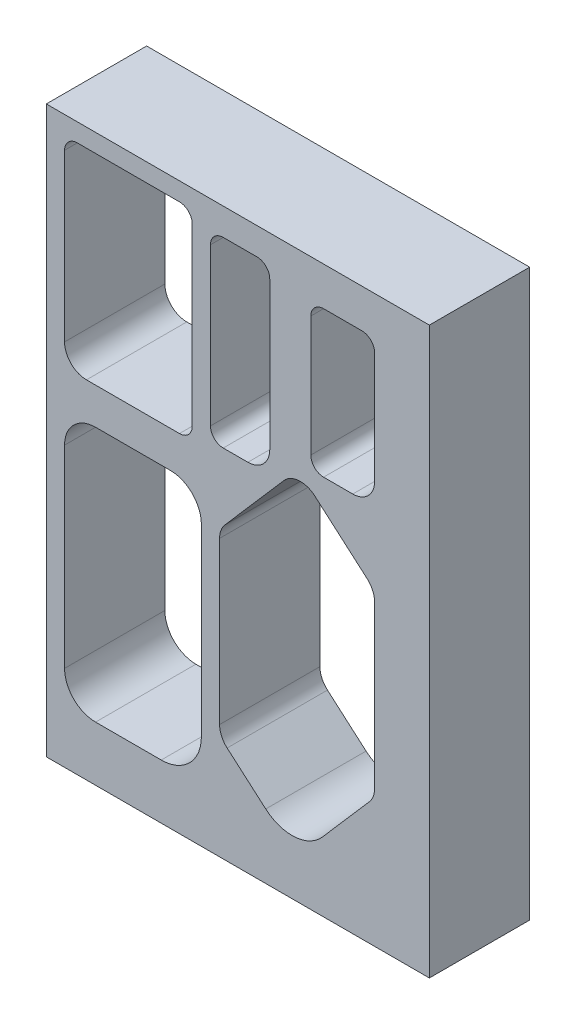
from build123d import *

# Parameters (mm, degrees)
SKETCH1_W           = 133.35
SKETCH1_H           = 196.85
BOSS_EXTRUDE1_DEPTH = 34.925


with BuildPart() as part:
    # Sketch1 → Boss-Extrude1 (new body)
    with BuildSketch(Plane.XY):
        with Locations((-47.625, 79.375)):
            Rectangle(SKETCH1_W, SKETCH1_H)
        with BuildLine():
            Line((-100.33, 101.6), (-67.945, 101.6))
            ThreePointArc((-67.945, 101.6), (-64.801910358, 102.901910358), (-63.5, 106.045))
            Line((-63.5, 106.045), (-63.5, 167.005))
            ThreePointArc((-63.5, 167.005), (-64.801910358, 170.148089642), (-67.945, 171.45))
            Line((-67.945, 171.45), (-103.505, 171.45))
            ThreePointArc((-103.505, 171.45), (-106.648089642, 170.148089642), (-107.95, 167.005))
            Line((-107.95, 167.005), (-107.95, 109.22))
            ThreePointArc((-107.95, 109.22), (-105.718153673, 103.831846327), (-100.33, 101.6))
        make_face(mode=Mode.SUBTRACT)
        with BuildLine():
            Line((-107.95, 78.105), (-107.95, 10.795))
            ThreePointArc((-107.95, 10.795), (-104.788217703, 3.161782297), (-97.155, 0))
            Line((-97.155, 0), (-74.295, 0))
            ThreePointArc((-74.295, 0), (-64.416718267, 4.091718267), (-60.325, 13.97))
            Line((-60.325, 13.97), (-60.325, 78.105))
            ThreePointArc((-60.325, 78.105), (-63.486782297, 85.738217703), (-71.12, 88.9))
            Line((-71.12, 88.9), (-97.155, 88.9))
            ThreePointArc((-97.155, 88.9), (-104.788217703, 85.738217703), (-107.95, 78.105))
        make_face(mode=Mode.SUBTRACT)
        with BuildLine():
            Line((-18.206288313, 4.810008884), (-1.86667063, 23.62515132))
            ThreePointArc((-1.86667063, 23.62515132), (-0.481906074, 25.954673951), (0, 28.621510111))
            Line((0, 28.621510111), (0, 84.765331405))
            ThreePointArc((0, 84.765331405), (-0.686867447, 87.926988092), (-2.623641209, 90.518660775))
            Line((-2.623641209, 90.518660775), (-20.855391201, 106.351643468))
            ThreePointArc((-20.855391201, 106.351643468), (-26.387009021, 108.199491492), (-31.605079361, 105.594672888))
            Line((-31.605079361, 105.594672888), (-52.10832937, 81.985089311))
            ThreePointArc((-52.10832937, 81.985089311), (-53.493093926, 79.65556668), (-53.975, 76.98873052))
            Line((-53.975, 76.98873052), (-53.975, 20.844909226))
            ThreePointArc((-53.975, 20.844909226), (-53.288132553, 17.683252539), (-51.351358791, 15.091579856))
            Line((-51.351358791, 15.091579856), (-37.91404994, 3.422229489))
            ThreePointArc((-37.91404994, 3.422229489), (-27.772750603, 0.034508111), (-18.206288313, 4.810008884))
        make_face(mode=Mode.SUBTRACT)
        with BuildLine():
            Line((-36.5125, 112.475088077), (-36.5125, 163.910088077))
            ThreePointArc((-36.5125, 163.910088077), (-37.814410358, 167.05317772), (-40.9575, 168.355088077))
            Line((-40.9575, 168.355088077), (-52.705, 168.355088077))
            ThreePointArc((-52.705, 168.355088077), (-55.848089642, 167.05317772), (-57.15, 163.910088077))
            Line((-57.15, 163.910088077), (-57.15, 109.300088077))
            ThreePointArc((-57.15, 109.300088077), (-55.848089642, 106.156998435), (-52.705, 104.855088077))
            Line((-52.705, 104.855088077), (-44.1325, 104.855088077))
            ThreePointArc((-44.1325, 104.855088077), (-38.744346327, 107.086934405), (-36.5125, 112.475088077))
        make_face(mode=Mode.SUBTRACT)
        with BuildLine():
            Line((0, 121.1533274), (0, 159.8883274))
            ThreePointArc((0, 159.8883274), (-1.301910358, 163.031417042), (-4.445, 164.3333274))
            Line((-4.445, 164.3333274), (-17.78, 164.3333274))
            ThreePointArc((-17.78, 164.3333274), (-20.923089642, 163.031417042), (-22.225, 159.8883274))
            Line((-22.225, 159.8883274), (-22.225, 117.9783274))
            ThreePointArc((-22.225, 117.9783274), (-20.923089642, 114.835237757), (-17.78, 113.5333274))
            Line((-17.78, 113.5333274), (-7.62, 113.5333274))
            ThreePointArc((-7.62, 113.5333274), (-2.231846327, 115.765173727), (0, 121.1533274))
        make_face(mode=Mode.SUBTRACT)
    extrude(amount=-BOSS_EXTRUDE1_DEPTH)


solid = part.part
